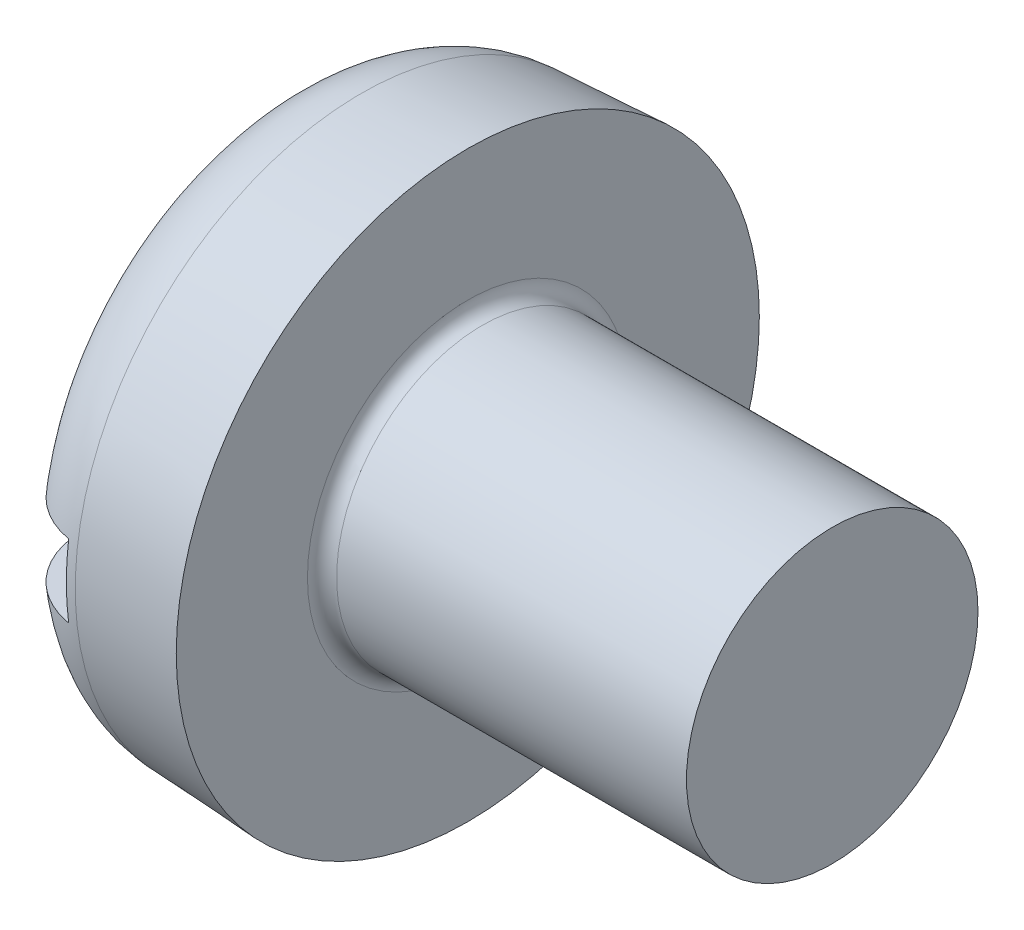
ISO-10303-21;
HEADER;
FILE_DESCRIPTION(('STEP AP214'),'2;1');
FILE_NAME('part.step','',(''),(''),'','','');
FILE_SCHEMA(('AUTOMOTIVE_DESIGN { 1 0 10303 214 1 1 1 1 }'));
ENDSEC;
DATA;
#1=APPLICATION_CONTEXT('core data for automotive mechanical design processes');
#2=APPLICATION_PROTOCOL_DEFINITION('international standard','automotive_design',2000,#1);
#3=PRODUCT_CONTEXT('',#1,'mechanical');
#4=PRODUCT('Part','Part','',(#3));
#5=PRODUCT_RELATED_PRODUCT_CATEGORY('part','',(#4));
#6=PRODUCT_DEFINITION_FORMATION('','',#4);
#7=PRODUCT_DEFINITION_CONTEXT('part definition',#1,'design');
#8=PRODUCT_DEFINITION('design','',#6,#7);
#9=PRODUCT_DEFINITION_SHAPE('','',#8);
#10=(LENGTH_UNIT() NAMED_UNIT(*) SI_UNIT(.MILLI.,.METRE.));
#11=(NAMED_UNIT(*) PLANE_ANGLE_UNIT() SI_UNIT($,.RADIAN.));
#12=(NAMED_UNIT(*) SI_UNIT($,.STERADIAN.) SOLID_ANGLE_UNIT());
#13=UNCERTAINTY_MEASURE_WITH_UNIT(LENGTH_MEASURE(1.E-05),#10,'distance_accuracy_value','');
#14=(GEOMETRIC_REPRESENTATION_CONTEXT(3) GLOBAL_UNCERTAINTY_ASSIGNED_CONTEXT((#13)) GLOBAL_UNIT_ASSIGNED_CONTEXT((#10,
#11,#12)) REPRESENTATION_CONTEXT('',''));
#15=CARTESIAN_POINT('',(0.,0.,0.));
#16=DIRECTION('',(0.,0.,1.));
#17=DIRECTION('',(1.,0.,0.));
#18=AXIS2_PLACEMENT_3D('',#15,#16,#17);
#19=CARTESIAN_POINT('',(0.,0.,0.));
#20=DIRECTION('',(1.,0.,0.));
#21=DIRECTION('',(0.,0.,-1.));
#22=AXIS2_PLACEMENT_3D('',#19,#20,#21);
#23=PLANE('',#22);
#24=CARTESIAN_POINT('',(0.,0.,0.));
#25=DIRECTION('',(1.,0.,0.));
#26=DIRECTION('',(0.,0.,-1.));
#27=AXIS2_PLACEMENT_3D('',#24,#25,#26);
#28=CIRCLE('',#27,1.36249114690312);
#29=CARTESIAN_POINT('',(0.,0.25,1.33935884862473));
#30=VERTEX_POINT('',#29);
#31=CARTESIAN_POINT('',(0.,0.25,-1.33935884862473));
#32=VERTEX_POINT('',#31);
#33=EDGE_CURVE('E104',#30,#32,#28,.F.);
#34=ORIENTED_EDGE('',*,*,#33,.T.);
#35=DIRECTION('',(0.,0.,1.));
#36=VECTOR('',#35,1.);
#37=CARTESIAN_POINT('',(0.,0.25,-2.));
#38=LINE('',#37,#36);
#39=EDGE_CURVE('E96',#32,#30,#38,.T.);
#40=ORIENTED_EDGE('',*,*,#39,.T.);
#41=EDGE_LOOP('',(#34,#40));
#42=FACE_BOUND('',#41,.T.);
#43=ADVANCED_FACE('F43',(#42),#23,.F.);
#44=CARTESIAN_POINT('',(1.3,0.,0.));
#45=DIRECTION('',(1.,0.,0.));
#46=DIRECTION('',(0.,0.,-1.));
#47=AXIS2_PLACEMENT_3D('',#44,#45,#46);
#48=PLANE('',#47);
#49=CARTESIAN_POINT('',(1.3,0.,0.));
#50=DIRECTION('',(1.,0.,0.));
#51=DIRECTION('',(0.,0.,-1.));
#52=AXIS2_PLACEMENT_3D('',#49,#50,#51);
#53=CIRCLE('',#52,1.1);
#54=CARTESIAN_POINT('',(1.3,0.,-1.1));
#55=VERTEX_POINT('',#54);
#56=EDGE_CURVE('E11',#55,#55,#53,.F.);
#57=ORIENTED_EDGE('',*,*,#56,.T.);
#58=EDGE_LOOP('',(#57));
#59=FACE_BOUND('',#58,.T.);
#60=CARTESIAN_POINT('',(1.3,0.,0.));
#61=DIRECTION('',(1.,0.,0.));
#62=DIRECTION('',(0.,0.,-1.));
#63=AXIS2_PLACEMENT_3D('',#60,#61,#62);
#64=CIRCLE('',#63,2.);
#65=CARTESIAN_POINT('',(1.3,0.,-2.));
#66=VERTEX_POINT('',#65);
#67=EDGE_CURVE('E178',#66,#66,#64,.T.);
#68=ORIENTED_EDGE('',*,*,#67,.T.);
#69=EDGE_LOOP('',(#68));
#70=FACE_BOUND('',#69,.T.);
#71=ADVANCED_FACE('F155',(#59,#70),#48,.T.);
#72=CARTESIAN_POINT('',(1.3,0.,0.));
#73=DIRECTION('',(1.,0.,0.));
#74=DIRECTION('',(0.,0.,-1.));
#75=AXIS2_PLACEMENT_3D('',#72,#73,#74);
#76=CONICAL_SURFACE('',#75,2.,0.05235987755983);
#77=CARTESIAN_POINT('',(0.568598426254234,0.,0.));
#78=DIRECTION('',(1.,0.,0.));
#79=DIRECTION('',(0.,0.,-1.));
#80=AXIS2_PLACEMENT_3D('',#77,#78,#79);
#81=CIRCLE('',#80,1.96166886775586);
#82=CARTESIAN_POINT('',(0.568598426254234,0.,-1.96166886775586));
#83=VERTEX_POINT('',#82);
#84=EDGE_CURVE('E108',#83,#83,#81,.T.);
#85=ORIENTED_EDGE('',*,*,#84,.T.);
#86=EDGE_LOOP('',(#85));
#87=FACE_BOUND('',#86,.T.);
#88=ORIENTED_EDGE('',*,*,#67,.F.);
#89=EDGE_LOOP('',(#88));
#90=FACE_BOUND('',#89,.T.);
#91=ADVANCED_FACE('F157',(#87,#90),#76,.T.);
#92=CARTESIAN_POINT('',(0.,-0.25,-1.33935884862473));
#93=VERTEX_POINT('',#92);
#94=CARTESIAN_POINT('',(0.,-0.25,1.33935884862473));
#95=VERTEX_POINT('',#94);
#96=EDGE_CURVE('E97',#93,#95,#28,.F.);
#97=ORIENTED_EDGE('',*,*,#96,.T.);
#98=DIRECTION('',(0.,0.,1.));
#99=VECTOR('',#98,1.);
#100=CARTESIAN_POINT('',(0.,-0.25,-2.));
#101=LINE('',#100,#99);
#102=EDGE_CURVE('E59',#93,#95,#101,.T.);
#103=ORIENTED_EDGE('',*,*,#102,.F.);
#104=EDGE_LOOP('',(#97,#103));
#105=FACE_BOUND('',#104,.T.);
#106=ADVANCED_FACE('F98',(#105),#23,.F.);
#107=CARTESIAN_POINT('',(3.8,0.,0.));
#108=DIRECTION('',(-1.,0.,0.));
#109=DIRECTION('',(0.,0.,1.));
#110=AXIS2_PLACEMENT_3D('',#107,#108,#109);
#111=CYLINDRICAL_SURFACE('',#110,1.);
#112=CARTESIAN_POINT('',(1.4,0.,0.));
#113=DIRECTION('',(1.,0.,0.));
#114=DIRECTION('',(0.,0.,-1.));
#115=AXIS2_PLACEMENT_3D('',#112,#113,#114);
#116=CIRCLE('',#115,1.);
#117=CARTESIAN_POINT('',(1.4,0.,-1.));
#118=VERTEX_POINT('',#117);
#119=EDGE_CURVE('E51',#118,#118,#116,.T.);
#120=ORIENTED_EDGE('',*,*,#119,.T.);
#121=EDGE_LOOP('',(#120));
#122=FACE_BOUND('',#121,.T.);
#123=CARTESIAN_POINT('',(3.8,0.,0.));
#124=DIRECTION('',(1.,0.,0.));
#125=DIRECTION('',(0.,0.,-1.));
#126=AXIS2_PLACEMENT_3D('',#123,#124,#125);
#127=CIRCLE('',#126,1.);
#128=CARTESIAN_POINT('',(3.8,0.,-1.));
#129=VERTEX_POINT('',#128);
#130=EDGE_CURVE('E181',#129,#129,#127,.T.);
#131=ORIENTED_EDGE('',*,*,#130,.F.);
#132=EDGE_LOOP('',(#131));
#133=FACE_BOUND('',#132,.T.);
#134=ADVANCED_FACE('F145',(#122,#133),#111,.T.);
#135=CARTESIAN_POINT('',(3.8,0.,0.));
#136=DIRECTION('',(1.,0.,0.));
#137=DIRECTION('',(0.,0.,-1.));
#138=AXIS2_PLACEMENT_3D('',#135,#136,#137);
#139=PLANE('',#138);
#140=ORIENTED_EDGE('',*,*,#130,.T.);
#141=EDGE_LOOP('',(#140));
#142=FACE_BOUND('',#141,.T.);
#143=ADVANCED_FACE('F166',(#142),#139,.T.);
#144=CARTESIAN_POINT('',(0.6,0.,0.));
#145=DIRECTION('',(1.,0.,0.));
#146=DIRECTION('',(0.,0.,-1.));
#147=AXIS2_PLACEMENT_3D('',#144,#145,#146);
#148=TOROIDAL_SURFACE('',#147,1.36249114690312,0.6);
#149=CARTESIAN_POINT('',(0.274857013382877,0.25,-1.849938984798));
#150=CARTESIAN_POINT('',(0.302936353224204,0.25,-1.86820702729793));
#151=CARTESIAN_POINT('',(0.332572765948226,0.25,-1.88412501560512));
#152=CARTESIAN_POINT('',(0.394120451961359,0.25,-1.91077520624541));
#153=CARTESIAN_POINT('',(0.426034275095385,0.25,-1.92150148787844));
#154=CARTESIAN_POINT('',(0.49120380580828,0.25,-1.93743324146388));
#155=CARTESIAN_POINT('',(0.524459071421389,0.25,-1.94264051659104));
#156=CARTESIAN_POINT('',(0.59136310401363,0.25,-1.94738383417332));
#157=CARTESIAN_POINT('',(0.625011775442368,0.25,-1.94692122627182));
#158=CARTESIAN_POINT('',(0.691689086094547,0.25,-1.94034863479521));
#159=CARTESIAN_POINT('',(0.724718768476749,0.25,-1.93424922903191));
#160=CARTESIAN_POINT('',(0.789287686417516,0.25,-1.91659655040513));
#161=CARTESIAN_POINT('',(0.820826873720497,0.25,-1.90504310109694));
#162=CARTESIAN_POINT('',(0.88155458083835,0.25,-1.87680629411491));
#163=CARTESIAN_POINT('',(0.910740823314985,0.25,-1.86011804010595));
#164=CARTESIAN_POINT('',(0.965914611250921,0.25,-1.82210085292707));
#165=CARTESIAN_POINT('',(0.991902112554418,0.25,-1.80077185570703));
#166=CARTESIAN_POINT('',(1.04008275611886,0.25,-1.75397339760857));
#167=CARTESIAN_POINT('',(1.0622567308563,0.25,-1.72848420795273));
#168=CARTESIAN_POINT('',(1.10205491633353,0.25,-1.67417327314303));
#169=CARTESIAN_POINT('',(1.11967897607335,0.25,-1.6453514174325));
#170=CARTESIAN_POINT('',(1.15005364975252,0.25,-1.58492097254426));
#171=CARTESIAN_POINT('',(1.16275913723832,0.25,-1.55328970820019));
#172=CARTESIAN_POINT('',(1.18275419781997,0.25,-1.48836055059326));
#173=CARTESIAN_POINT('',(1.19004345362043,0.25,-1.45506255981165));
#174=CARTESIAN_POINT('',(1.19910602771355,0.25,-1.38728543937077));
#175=CARTESIAN_POINT('',(1.20080664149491,0.25,-1.35279659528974));
#176=CARTESIAN_POINT('',(1.19848636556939,0.25,-1.28401260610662));
#177=CARTESIAN_POINT('',(1.19446500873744,0.25,-1.24971747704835));
#178=CARTESIAN_POINT('',(1.18074505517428,0.25,-1.18173220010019));
#179=CARTESIAN_POINT('',(1.17096001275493,0.25,-1.14805949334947));
#180=CARTESIAN_POINT('',(1.14594404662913,0.25,-1.08280004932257));
#181=CARTESIAN_POINT('',(1.1307125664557,0.25,-1.05121352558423));
#182=CARTESIAN_POINT('',(1.09501500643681,0.25,-0.990638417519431));
#183=CARTESIAN_POINT('',(1.07448864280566,0.25,-0.961685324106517));
#184=CARTESIAN_POINT('',(1.0288425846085,0.25,-0.907651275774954));
#185=CARTESIAN_POINT('',(1.00372253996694,0.25,-0.882570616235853));
#186=CARTESIAN_POINT('',(0.949701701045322,0.25,-0.837204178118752));
#187=CARTESIAN_POINT('',(0.92082244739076,0.25,-0.816892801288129));
#188=CARTESIAN_POINT('',(0.859958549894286,0.25,-0.781624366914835));
#189=CARTESIAN_POINT('',(0.827974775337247,0.25,-0.766665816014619));
#190=CARTESIAN_POINT('',(0.763077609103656,0.25,-0.743184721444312));
#191=CARTESIAN_POINT('',(0.730244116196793,0.25,-0.734441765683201));
#192=CARTESIAN_POINT('',(0.663551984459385,0.25,-0.722905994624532));
#193=CARTESIAN_POINT('',(0.629693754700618,0.25,-0.72011083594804));
#194=CARTESIAN_POINT('',(0.563641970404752,0.25,-0.720591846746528));
#195=CARTESIAN_POINT('',(0.531445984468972,0.25,-0.723585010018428));
#196=CARTESIAN_POINT('',(0.468019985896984,0.25,-0.734949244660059));
#197=CARTESIAN_POINT('',(0.436790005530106,0.25,-0.743320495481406));
#198=CARTESIAN_POINT('',(0.376193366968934,0.25,-0.765073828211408));
#199=CARTESIAN_POINT('',(0.34682374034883,0.25,-0.778447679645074));
#200=CARTESIAN_POINT('',(0.290607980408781,0.25,-0.809726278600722));
#201=CARTESIAN_POINT('',(0.26376234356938,0.25,-0.827631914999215));
#202=CARTESIAN_POINT('',(0.212060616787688,0.25,-0.868327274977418));
#203=CARTESIAN_POINT('',(0.187349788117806,0.25,-0.891301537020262));
#204=CARTESIAN_POINT('',(0.141945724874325,0.25,-0.940926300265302));
#205=CARTESIAN_POINT('',(0.121253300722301,0.25,-0.967577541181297));
#206=CARTESIAN_POINT('',(0.0836353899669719,0.25,-1.02499135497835));
#207=CARTESIAN_POINT('',(0.0668976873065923,0.25,-1.05587718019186));
#208=CARTESIAN_POINT('',(0.0387781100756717,0.25,-1.11999926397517));
#209=CARTESIAN_POINT('',(0.0273966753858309,0.25,-1.15323571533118));
#210=CARTESIAN_POINT('',(0.0102356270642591,0.25,-1.22151679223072));
#211=CARTESIAN_POINT('',(0.00451889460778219,0.25,-1.25657726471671));
#212=CARTESIAN_POINT('',(-0.000885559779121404,0.25,-1.32715990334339));
#213=CARTESIAN_POINT('',(-0.000573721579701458,0.25,-1.36268203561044));
#214=CARTESIAN_POINT('',(0.00608419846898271,0.25,-1.43280639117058));
#215=CARTESIAN_POINT('',(0.0123711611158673,0.25,-1.46741421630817));
#216=CARTESIAN_POINT('',(0.030761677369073,0.25,-1.53505954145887));
#217=CARTESIAN_POINT('',(0.0428662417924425,0.25,-1.56809676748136));
#218=CARTESIAN_POINT('',(0.07234801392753,0.25,-1.63111850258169));
#219=CARTESIAN_POINT('',(0.0896431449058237,0.25,-1.66114146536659));
#220=CARTESIAN_POINT('',(0.129084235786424,0.25,-1.71777423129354));
#221=CARTESIAN_POINT('',(0.151223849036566,0.25,-1.74438842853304));
#222=CARTESIAN_POINT('',(0.190518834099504,0.25,-1.78413013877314));
#223=CARTESIAN_POINT('',(0.206389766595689,0.25,-1.79855000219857));
#224=CARTESIAN_POINT('',(0.239580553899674,0.25,-1.82561325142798));
#225=CARTESIAN_POINT('',(0.256900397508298,0.25,-1.83825665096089));
#226=CARTESIAN_POINT('',(0.274857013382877,0.25,-1.849938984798));
#227=B_SPLINE_CURVE_WITH_KNOTS('',3,(#149,#150,#151,#152,#153,#154,#155,#156,#157,#158,#159,
#160,#161,#162,#163,#164,#165,#166,#167,#168,#169,#170,#171,#172,#173,#174,#175,#176,#177,#178,
#179,#180,#181,#182,#183,#184,#185,#186,#187,#188,#189,#190,#191,#192,#193,#194,#195,#196,#197,
#198,#199,#200,#201,#202,#203,#204,#205,#206,#207,#208,#209,#210,#211,#212,#213,#214,#215,#216,
#217,#218,#219,#220,#221,#222,#223,#224,#225,#226),.UNSPECIFIED.,.T.,.F.,(4,2,2,2,2,2,2,2,2,2,2,
2,2,2,2,2,2,2,2,2,2,2,2,2,2,2,2,2,2,2,2,2,2,2,2,2,2,2,4),(0.,0.100418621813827,
0.200951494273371,0.301451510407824,0.401927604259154,0.502215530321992,0.602506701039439,
0.702893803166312,0.80328229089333,0.904161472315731,1.00504400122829,1.10683132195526,
1.20862460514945,1.31173701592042,1.41485784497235,1.51956617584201,1.62428520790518,
1.73025359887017,1.83623006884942,1.94162401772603,2.0469885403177,2.14839996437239,
2.24977142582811,2.34631159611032,2.44285498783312,2.53924023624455,2.63564440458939,
2.73641666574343,2.83720922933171,2.94210761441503,3.04701461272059,3.15307350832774,
3.25912466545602,3.36413733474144,3.46916825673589,3.57261880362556,3.67593462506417,
3.74015239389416,3.80436966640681),.UNSPECIFIED.);
#228=CARTESIAN_POINT('',(0.5,0.25,-1.93804112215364));
#229=VERTEX_POINT('',#228);
#230=EDGE_CURVE('E132',#32,#229,#227,.T.);
#231=ORIENTED_EDGE('',*,*,#230,.F.);
#232=ORIENTED_EDGE('',*,*,#33,.F.);
#233=CARTESIAN_POINT('',(0.263812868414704,0.25,0.828630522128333));
#234=CARTESIAN_POINT('',(0.29069689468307,0.25,0.809635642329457));
#235=CARTESIAN_POINT('',(0.319137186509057,0.25,0.792812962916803));
#236=CARTESIAN_POINT('',(0.378430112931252,0.25,0.764099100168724));
#237=CARTESIAN_POINT('',(0.409284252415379,0.25,0.752211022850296));
#238=CARTESIAN_POINT('',(0.472622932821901,0.25,0.733837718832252));
#239=CARTESIAN_POINT('',(0.505109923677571,0.25,0.727360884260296));
#240=CARTESIAN_POINT('',(0.570707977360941,0.25,0.720141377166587));
#241=CARTESIAN_POINT('',(0.603818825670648,0.25,0.719396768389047));
#242=CARTESIAN_POINT('',(0.668731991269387,0.25,0.723610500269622));
#243=CARTESIAN_POINT('',(0.700544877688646,0.25,0.72840860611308));
#244=CARTESIAN_POINT('',(0.762926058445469,0.25,0.743234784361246));
#245=CARTESIAN_POINT('',(0.793494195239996,0.25,0.753263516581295));
#246=CARTESIAN_POINT('',(0.852845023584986,0.25,0.778263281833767));
#247=CARTESIAN_POINT('',(0.881609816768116,0.25,0.793276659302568));
#248=CARTESIAN_POINT('',(0.936370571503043,0.25,0.827703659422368));
#249=CARTESIAN_POINT('',(0.962365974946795,0.25,0.847118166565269));
#250=CARTESIAN_POINT('',(1.01217101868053,0.25,0.890802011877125));
#251=CARTESIAN_POINT('',(1.0358152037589,0.25,0.915260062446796));
#252=CARTESIAN_POINT('',(1.07884068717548,0.25,0.96767606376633));
#253=CARTESIAN_POINT('',(1.09822119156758,0.25,0.995634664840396));
#254=CARTESIAN_POINT('',(1.13285489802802,0.25,1.0553731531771));
#255=CARTESIAN_POINT('',(1.14793269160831,0.25,1.08725492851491));
#256=CARTESIAN_POINT('',(1.17256277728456,0.25,1.15308743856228));
#257=CARTESIAN_POINT('',(1.18211474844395,0.25,1.18703829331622));
#258=CARTESIAN_POINT('',(1.19543713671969,0.25,1.25628591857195));
#259=CARTESIAN_POINT('',(1.19916998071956,0.25,1.29158994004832));
#260=CARTESIAN_POINT('',(1.20058228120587,0.25,1.3623201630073));
#261=CARTESIAN_POINT('',(1.19826201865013,0.25,1.39774635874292));
#262=CARTESIAN_POINT('',(1.18764933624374,0.25,1.46727585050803));
#263=CARTESIAN_POINT('',(1.17942605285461,0.25,1.50138968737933));
#264=CARTESIAN_POINT('',(1.15727777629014,0.25,1.56771423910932));
#265=CARTESIAN_POINT('',(1.14335324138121,0.25,1.59992510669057));
#266=CARTESIAN_POINT('',(1.11043434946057,0.25,1.66099593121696));
#267=CARTESIAN_POINT('',(1.09152222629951,0.25,1.68990021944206));
#268=CARTESIAN_POINT('',(1.04905354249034,0.25,1.74406804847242));
#269=CARTESIAN_POINT('',(1.02549732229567,0.25,1.76933185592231));
#270=CARTESIAN_POINT('',(0.974745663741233,0.25,1.81515586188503));
#271=CARTESIAN_POINT('',(0.947601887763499,0.25,1.83577329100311));
#272=CARTESIAN_POINT('',(0.890212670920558,0.25,1.87210973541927));
#273=CARTESIAN_POINT('',(0.859967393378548,0.25,1.88782900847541));
#274=CARTESIAN_POINT('',(0.79752605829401,0.25,1.9137825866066));
#275=CARTESIAN_POINT('',(0.765349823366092,0.25,1.92406459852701));
#276=CARTESIAN_POINT('',(0.699723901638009,0.25,1.93905196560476));
#277=CARTESIAN_POINT('',(0.666274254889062,0.25,1.94375749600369));
#278=CARTESIAN_POINT('',(0.599220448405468,0.25,1.94744392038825));
#279=CARTESIAN_POINT('',(0.565617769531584,0.25,1.94645180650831));
#280=CARTESIAN_POINT('',(0.499057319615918,0.25,1.93883518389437));
#281=CARTESIAN_POINT('',(0.466099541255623,0.25,1.93221073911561));
#282=CARTESIAN_POINT('',(0.401789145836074,0.25,1.91353136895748));
#283=CARTESIAN_POINT('',(0.370435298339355,0.25,1.90148067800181));
#284=CARTESIAN_POINT('',(0.310187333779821,0.25,1.8723020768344));
#285=CARTESIAN_POINT('',(0.281293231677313,0.25,1.8551741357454));
#286=CARTESIAN_POINT('',(0.226684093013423,0.25,1.81627753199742));
#287=CARTESIAN_POINT('',(0.200979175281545,0.25,1.79449466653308));
#288=CARTESIAN_POINT('',(0.153560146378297,0.25,1.74695000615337));
#289=CARTESIAN_POINT('',(0.131846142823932,0.25,1.72118810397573));
#290=CARTESIAN_POINT('',(0.0928534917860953,0.25,1.66622636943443));
#291=CARTESIAN_POINT('',(0.0756074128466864,0.25,1.63700343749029));
#292=CARTESIAN_POINT('',(0.0462048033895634,0.25,1.57610160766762));
#293=CARTESIAN_POINT('',(0.0340485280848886,0.25,1.54442258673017));
#294=CARTESIAN_POINT('',(0.0150174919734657,0.25,1.47913025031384));
#295=CARTESIAN_POINT('',(0.00820357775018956,0.25,1.44549920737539));
#296=CARTESIAN_POINT('',(0.000231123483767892,0.25,1.37757567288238));
#297=CARTESIAN_POINT('',(-0.000927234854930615,0.25,1.34328316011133));
#298=CARTESIAN_POINT('',(0.00242309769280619,0.25,1.27447559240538));
#299=CARTESIAN_POINT('',(0.00701461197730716,0.25,1.23996457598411));
#300=CARTESIAN_POINT('',(0.0218410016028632,0.25,1.17216760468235));
#301=CARTESIAN_POINT('',(0.0320777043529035,0.25,1.13888205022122));
#302=CARTESIAN_POINT('',(0.058082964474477,0.25,1.07396328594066));
#303=CARTESIAN_POINT('',(0.0739328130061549,0.25,1.0423626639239));
#304=CARTESIAN_POINT('',(0.110678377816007,0.25,0.982274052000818));
#305=CARTESIAN_POINT('',(0.131569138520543,0.25,0.953783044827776));
#306=CARTESIAN_POINT('',(0.170842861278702,0.25,0.908735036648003));
#307=CARTESIAN_POINT('',(0.188083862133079,0.25,0.891169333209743));
#308=CARTESIAN_POINT('',(0.224531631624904,0.25,0.858208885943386));
#309=CARTESIAN_POINT('',(0.243738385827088,0.25,0.842814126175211));
#310=CARTESIAN_POINT('',(0.263812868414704,0.25,0.828630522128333));
#311=B_SPLINE_CURVE_WITH_KNOTS('',3,(#233,#234,#235,#236,#237,#238,#239,#240,#241,#242,#243,
#244,#245,#246,#247,#248,#249,#250,#251,#252,#253,#254,#255,#256,#257,#258,#259,#260,#261,#262,
#263,#264,#265,#266,#267,#268,#269,#270,#271,#272,#273,#274,#275,#276,#277,#278,#279,#280,#281,
#282,#283,#284,#285,#286,#287,#288,#289,#290,#291,#292,#293,#294,#295,#296,#297,#298,#299,#300,
#301,#302,#303,#304,#305,#306,#307,#308,#309,#310),.UNSPECIFIED.,.T.,.F.,(4,2,2,2,2,2,2,2,2,2,2,
2,2,2,2,2,2,2,2,2,2,2,2,2,2,2,2,2,2,2,2,2,2,2,2,2,2,2,4),(0.,0.0986685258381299,
0.197399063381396,0.29628243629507,0.39513240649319,0.491194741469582,0.58726919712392,
0.684181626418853,0.781113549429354,0.882711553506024,0.984328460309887,1.08963497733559,
1.19494760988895,1.30093745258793,1.40692237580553,1.51168583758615,1.61644088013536,
1.71956638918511,1.82268434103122,1.92445275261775,2.02621580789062,2.12707051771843,
2.22792205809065,2.32829621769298,2.42866923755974,2.52896406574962,2.62925950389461,
2.7298654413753,2.83047409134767,2.93179670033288,3.03312438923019,3.13559002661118,
3.23805895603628,3.34202101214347,3.44601674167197,3.55158468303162,3.65704926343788,
3.73072625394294,3.80440270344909),.UNSPECIFIED.);
#312=CARTESIAN_POINT('',(0.5,0.25,1.93804112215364));
#313=VERTEX_POINT('',#312);
#314=EDGE_CURVE('E95',#313,#30,#311,.T.);
#315=ORIENTED_EDGE('',*,*,#314,.F.);
#316=CARTESIAN_POINT('',(0.5,0.,0.));
#317=DIRECTION('',(1.,0.,0.));
#318=DIRECTION('',(0.,1.,0.));
#319=AXIS2_PLACEMENT_3D('',#316,#317,#318);
#320=CIRCLE('',#319,1.95409912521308);
#321=CARTESIAN_POINT('',(0.5,-0.25,1.93804112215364));
#322=VERTEX_POINT('',#321);
#323=EDGE_CURVE('E68',#322,#313,#320,.F.);
#324=ORIENTED_EDGE('',*,*,#323,.F.);
#325=CARTESIAN_POINT('',(0.263812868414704,-0.25,0.828630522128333));
#326=CARTESIAN_POINT('',(0.235224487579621,-0.25,0.848832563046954));
#327=CARTESIAN_POINT('',(0.208355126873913,-0.25,0.871521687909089));
#328=CARTESIAN_POINT('',(0.158788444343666,-0.25,0.921121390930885));
#329=CARTESIAN_POINT('',(0.136098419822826,-0.25,0.948039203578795));
#330=CARTESIAN_POINT('',(0.0955453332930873,-0.25,1.00524201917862));
#331=CARTESIAN_POINT('',(0.0776758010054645,-0.25,1.03552243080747));
#332=CARTESIAN_POINT('',(0.0472181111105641,-0.25,1.09861633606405));
#333=CARTESIAN_POINT('',(0.0346279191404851,-0.25,1.13142884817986));
#334=CARTESIAN_POINT('',(0.01498078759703,-0.25,1.19905246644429));
#335=CARTESIAN_POINT('',(0.00798404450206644,-0.25,1.23388109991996));
#336=CARTESIAN_POINT('',(-1.14958607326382E-05,-0.25,1.30422444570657));
#337=CARTESIAN_POINT('',(-0.00100998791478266,-0.25,1.33973919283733));
#338=CARTESIAN_POINT('',(0.00305166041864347,-0.25,1.41012688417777));
#339=CARTESIAN_POINT('',(0.00806167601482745,-0.25,1.44500270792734));
#340=CARTESIAN_POINT('',(0.0239595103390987,-0.25,1.51338868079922));
#341=CARTESIAN_POINT('',(0.0348468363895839,-0.25,1.54689894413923));
#342=CARTESIAN_POINT('',(0.0620088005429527,-0.25,1.61105155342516));
#343=CARTESIAN_POINT('',(0.0781979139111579,-0.25,1.64173011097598));
#344=CARTESIAN_POINT('',(0.115567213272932,-0.25,1.69988038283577));
#345=CARTESIAN_POINT('',(0.136747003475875,-0.25,1.7273523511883));
#346=CARTESIAN_POINT('',(0.183170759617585,-0.25,1.77790333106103));
#347=CARTESIAN_POINT('',(0.20835339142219,-0.25,1.80103868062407));
#348=CARTESIAN_POINT('',(0.262279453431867,-0.25,1.84270088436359));
#349=CARTESIAN_POINT('',(0.291022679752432,-0.25,1.86122800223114));
#350=CARTESIAN_POINT('',(0.350938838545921,-0.25,1.89295713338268));
#351=CARTESIAN_POINT('',(0.382084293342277,-0.25,1.90621104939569));
#352=CARTESIAN_POINT('',(0.446166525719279,-0.25,1.92726691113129));
#353=CARTESIAN_POINT('',(0.479103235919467,-0.25,1.93506906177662));
#354=CARTESIAN_POINT('',(0.545625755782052,-0.25,1.94496067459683));
#355=CARTESIAN_POINT('',(0.579206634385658,-0.25,1.94708332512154));
#356=CARTESIAN_POINT('',(0.646246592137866,-0.25,1.94564923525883));
#357=CARTESIAN_POINT('',(0.679705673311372,-0.25,1.94209258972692));
#358=CARTESIAN_POINT('',(0.745488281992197,-0.25,1.92941655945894));
#359=CARTESIAN_POINT('',(0.777813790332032,-0.25,1.92030744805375));
#360=CARTESIAN_POINT('',(0.840481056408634,-0.25,1.89680209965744));
#361=CARTESIAN_POINT('',(0.870822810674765,-0.25,1.88240585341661));
#362=CARTESIAN_POINT('',(0.928731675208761,-0.25,1.84871105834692));
#363=CARTESIAN_POINT('',(0.956293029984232,-0.249999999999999,1.82940262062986));
#364=CARTESIAN_POINT('',(1.00780674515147,-0.249999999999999,1.78645801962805));
#365=CARTESIAN_POINT('',(1.03175903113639,-0.249999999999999,1.7628217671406));
#366=CARTESIAN_POINT('',(1.07553458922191,-0.249999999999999,1.71174700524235));
#367=CARTESIAN_POINT('',(1.09533229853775,-0.249999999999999,1.68428659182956));
#368=CARTESIAN_POINT('',(1.13008922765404,-0.249999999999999,1.62645897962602));
#369=CARTESIAN_POINT('',(1.14504825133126,-0.249999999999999,1.59609166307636));
#370=CARTESIAN_POINT('',(1.16987221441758,-0.249999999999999,1.53298784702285));
#371=CARTESIAN_POINT('',(1.17968419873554,-0.249999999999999,1.50023052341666));
#372=CARTESIAN_POINT('',(1.19375141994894,-0.249999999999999,1.43354483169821));
#373=CARTESIAN_POINT('',(1.19800629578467,-0.249999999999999,1.39961638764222));
#374=CARTESIAN_POINT('',(1.20090606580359,-0.249999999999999,1.33104884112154));
#375=CARTESIAN_POINT('',(1.1994722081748,-0.249999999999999,1.29640641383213));
#376=CARTESIAN_POINT('',(1.19090077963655,-0.249999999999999,1.22783492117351));
#377=CARTESIAN_POINT('',(1.18376271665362,-0.249999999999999,1.19390591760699));
#378=CARTESIAN_POINT('',(1.1638600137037,-0.249999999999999,1.12717293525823));
#379=CARTESIAN_POINT('',(1.15101086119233,-0.249999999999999,1.09439415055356));
#380=CARTESIAN_POINT('',(1.12004164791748,-0.249999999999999,1.03142582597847));
#381=CARTESIAN_POINT('',(1.1019210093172,-0.249999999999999,1.00123657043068));
#382=CARTESIAN_POINT('',(1.06071562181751,-0.249999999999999,0.944044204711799));
#383=CARTESIAN_POINT('',(1.03758799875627,-0.249999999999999,0.917071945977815));
#384=CARTESIAN_POINT('',(0.987077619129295,-0.249999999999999,0.867449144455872));
#385=CARTESIAN_POINT('',(0.959694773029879,-0.25,0.844798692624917));
#386=CARTESIAN_POINT('',(0.901798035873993,-0.25,0.804862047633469));
#387=CARTESIAN_POINT('',(0.87133108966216,-0.25,0.787507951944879));
#388=CARTESIAN_POINT('',(0.807818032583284,-0.25,0.758439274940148));
#389=CARTESIAN_POINT('',(0.774773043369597,-0.25,0.746722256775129));
#390=CARTESIAN_POINT('',(0.70863254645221,-0.25,0.729846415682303));
#391=CARTESIAN_POINT('',(0.675606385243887,-0.25,0.724415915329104));
#392=CARTESIAN_POINT('',(0.609107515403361,-0.25,0.719437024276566));
#393=CARTESIAN_POINT('',(0.575634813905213,-0.25,0.719888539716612));
#394=CARTESIAN_POINT('',(0.510611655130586,-0.25,0.726513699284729));
#395=CARTESIAN_POINT('',(0.479037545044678,-0.25,0.732460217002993));
#396=CARTESIAN_POINT('',(0.417338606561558,-0.25,0.74949345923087));
#397=CARTESIAN_POINT('',(0.387212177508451,-0.25,0.760574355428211));
#398=CARTESIAN_POINT('',(0.341675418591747,-0.25,0.781643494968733));
#399=CARTESIAN_POINT('',(0.325512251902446,-0.25,0.790049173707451));
#400=CARTESIAN_POINT('',(0.29401537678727,-0.25,0.808289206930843));
#401=CARTESIAN_POINT('',(0.278681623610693,-0.25,0.818123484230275));
#402=CARTESIAN_POINT('',(0.263812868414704,-0.25,0.828630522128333));
#403=B_SPLINE_CURVE_WITH_KNOTS('',3,(#325,#326,#327,#328,#329,#330,#331,#332,#333,#334,#335,
#336,#337,#338,#339,#340,#341,#342,#343,#344,#345,#346,#347,#348,#349,#350,#351,#352,#353,#354,
#355,#356,#357,#358,#359,#360,#361,#362,#363,#364,#365,#366,#367,#368,#369,#370,#371,#372,#373,
#374,#375,#376,#377,#378,#379,#380,#381,#382,#383,#384,#385,#386,#387,#388,#389,#390,#391,#392,
#393,#394,#395,#396,#397,#398,#399,#400,#401,#402),.UNSPECIFIED.,.T.,.F.,(4,2,2,2,2,2,2,2,2,2,2,
2,2,2,2,2,2,2,2,2,2,2,2,2,2,2,2,2,2,2,2,2,2,2,2,2,2,2,4),(0.,0.104949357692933,
0.210080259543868,0.315069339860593,0.420017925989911,0.526081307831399,0.632150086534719,
0.737340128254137,0.842521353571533,0.946083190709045,1.04963681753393,1.15173437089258,
1.25382608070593,1.35488647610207,1.45594307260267,1.55640783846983,1.6568709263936,
1.75714869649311,1.85742664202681,1.95790808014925,2.05839158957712,2.1594763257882,
2.26056515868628,2.36267459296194,2.46479066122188,2.56832526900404,2.67186880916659,
2.77699842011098,2.88213955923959,2.98821937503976,3.09430142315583,3.19895999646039,
3.3035732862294,3.40347354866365,3.50337221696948,3.5993179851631,3.6951551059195,
3.74974198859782,3.80432592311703),.UNSPECIFIED.);
#404=EDGE_CURVE('E101',#95,#322,#403,.T.);
#405=ORIENTED_EDGE('',*,*,#404,.F.);
#406=ORIENTED_EDGE('',*,*,#96,.F.);
#407=CARTESIAN_POINT('',(0.274857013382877,-0.25,-1.849938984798));
#408=CARTESIAN_POINT('',(0.246486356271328,-0.25,-1.83147774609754));
#409=CARTESIAN_POINT('',(0.219663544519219,-0.25,-1.81058961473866));
#410=CARTESIAN_POINT('',(0.169895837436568,-0.25,-1.76457655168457));
#411=CARTESIAN_POINT('',(0.146956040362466,-0.25,-1.73944613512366));
#412=CARTESIAN_POINT('',(0.10563152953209,-0.25,-1.6857186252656));
#413=CARTESIAN_POINT('',(0.087242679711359,-0.25,-1.65712471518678));
#414=CARTESIAN_POINT('',(0.0554888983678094,-0.25,-1.5972842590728));
#415=CARTESIAN_POINT('',(0.0421227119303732,-0.25,-1.56603837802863));
#416=CARTESIAN_POINT('',(0.0206538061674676,-0.25,-1.50150598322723));
#417=CARTESIAN_POINT('',(0.0125948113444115,-0.25,-1.46820493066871));
#418=CARTESIAN_POINT('',(0.00209594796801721,-0.25,-1.40072817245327));
#419=CARTESIAN_POINT('',(-0.000343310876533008,-0.25,-1.36655237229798));
#420=CARTESIAN_POINT('',(0.00042659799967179,-0.25,-1.2977735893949));
#421=CARTESIAN_POINT('',(0.00371744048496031,-0.25,-1.26317152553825));
#422=CARTESIAN_POINT('',(0.0159720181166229,-0.25,-1.19498712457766));
#423=CARTESIAN_POINT('',(0.024936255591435,-0.25,-1.16140487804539));
#424=CARTESIAN_POINT('',(0.0484391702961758,-0.25,-1.09567996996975));
#425=CARTESIAN_POINT('',(0.0630595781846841,-0.25,-1.06356651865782));
#426=CARTESIAN_POINT('',(0.0974480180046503,-0.25,-1.00222121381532));
#427=CARTESIAN_POINT('',(0.117216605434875,-0.25,-0.972989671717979));
#428=CARTESIAN_POINT('',(0.161518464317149,-0.25,-0.918067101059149));
#429=CARTESIAN_POINT('',(0.186082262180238,-0.25,-0.892400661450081));
#430=CARTESIAN_POINT('',(0.239242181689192,-0.25,-0.845642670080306));
#431=CARTESIAN_POINT('',(0.267838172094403,-0.25,-0.824550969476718));
#432=CARTESIAN_POINT('',(0.327723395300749,-0.25,-0.788039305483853));
#433=CARTESIAN_POINT('',(0.358952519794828,-0.25,-0.772520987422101));
#434=CARTESIAN_POINT('',(0.423661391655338,-0.25,-0.747252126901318));
#435=CARTESIAN_POINT('',(0.457140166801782,-0.25,-0.737499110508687));
#436=CARTESIAN_POINT('',(0.523670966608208,-0.25,-0.724536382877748));
#437=CARTESIAN_POINT('',(0.556666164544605,-0.25,-0.721034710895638));
#438=CARTESIAN_POINT('',(0.622758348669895,-0.25,-0.719836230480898));
#439=CARTESIAN_POINT('',(0.655855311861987,-0.25,-0.722138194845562));
#440=CARTESIAN_POINT('',(0.720052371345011,-0.25,-0.732260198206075));
#441=CARTESIAN_POINT('',(0.751182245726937,-0.25,-0.739893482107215));
#442=CARTESIAN_POINT('',(0.811768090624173,-0.25,-0.760157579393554));
#443=CARTESIAN_POINT('',(0.841223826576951,-0.25,-0.772789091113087));
#444=CARTESIAN_POINT('',(0.898404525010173,-0.25,-0.802945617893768));
#445=CARTESIAN_POINT('',(0.926071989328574,-0.25,-0.820579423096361));
#446=CARTESIAN_POINT('',(0.978239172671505,-0.25,-0.860033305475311));
#447=CARTESIAN_POINT('',(1.00273821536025,-0.249999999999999,-0.8818542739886));
#448=CARTESIAN_POINT('',(1.04912907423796,-0.249999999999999,-0.930234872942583));
#449=CARTESIAN_POINT('',(1.07083266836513,-0.249999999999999,-0.956975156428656));
#450=CARTESIAN_POINT('',(1.10959316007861,-0.249999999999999,-1.01363573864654));
#451=CARTESIAN_POINT('',(1.12664932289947,-0.249999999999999,-1.04355653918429));
#452=CARTESIAN_POINT('',(1.15607819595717,-0.249999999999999,-1.10665807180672));
#453=CARTESIAN_POINT('',(1.16830490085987,-0.249999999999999,-1.13990704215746));
#454=CARTESIAN_POINT('',(1.1870042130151,-0.249999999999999,-1.20798706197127));
#455=CARTESIAN_POINT('',(1.19347668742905,-0.249999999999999,-1.24281814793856));
#456=CARTESIAN_POINT('',(1.2004435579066,-0.249999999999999,-1.31307491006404));
#457=CARTESIAN_POINT('',(1.2009381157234,-0.249999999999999,-1.34850057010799));
#458=CARTESIAN_POINT('',(1.19588624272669,-0.249999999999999,-1.418919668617));
#459=CARTESIAN_POINT('',(1.19034018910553,-0.249999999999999,-1.4539131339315));
#460=CARTESIAN_POINT('',(1.17343956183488,-0.249999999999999,-1.52196071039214));
#461=CARTESIAN_POINT('',(1.16216544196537,-0.249999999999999,-1.55503479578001));
#462=CARTESIAN_POINT('',(1.13413930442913,-0.249999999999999,-1.61877525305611));
#463=CARTESIAN_POINT('',(1.11738772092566,-0.249999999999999,-1.64944181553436));
#464=CARTESIAN_POINT('',(1.07916208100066,-0.249999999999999,-1.70700040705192));
#465=CARTESIAN_POINT('',(1.05776398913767,-0.249999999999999,-1.73394289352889));
#466=CARTESIAN_POINT('',(1.01069799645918,-0.249999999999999,-1.78379750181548));
#467=CARTESIAN_POINT('',(0.98503037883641,-0.25,-1.80670989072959));
#468=CARTESIAN_POINT('',(0.930489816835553,-0.25,-1.84756820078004));
#469=CARTESIAN_POINT('',(0.90165906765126,-0.25,-1.8655704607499));
#470=CARTESIAN_POINT('',(0.841367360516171,-0.25,-1.89643419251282));
#471=CARTESIAN_POINT('',(0.809906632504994,-0.25,-1.90929611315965));
#472=CARTESIAN_POINT('',(0.745515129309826,-0.25,-1.92941695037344));
#473=CARTESIAN_POINT('',(0.712597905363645,-0.25,-1.9367192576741));
#474=CARTESIAN_POINT('',(0.645994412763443,-0.25,-1.9456728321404));
#475=CARTESIAN_POINT('',(0.612307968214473,-0.25,-1.94732279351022));
#476=CARTESIAN_POINT('',(0.54524907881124,-0.25,-1.94492497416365));
#477=CARTESIAN_POINT('',(0.511875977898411,-0.25,-1.94089519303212));
#478=CARTESIAN_POINT('',(0.446310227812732,-0.25,-1.92728944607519));
#479=CARTESIAN_POINT('',(0.414116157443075,-0.25,-1.91772040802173));
#480=CARTESIAN_POINT('',(0.364065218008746,-0.25,-1.89813779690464));
#481=CARTESIAN_POINT('',(0.34554473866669,-0.25,-1.8897758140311));
#482=CARTESIAN_POINT('',(0.309449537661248,-0.25,-1.87121328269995));
#483=CARTESIAN_POINT('',(0.291874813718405,-0.25,-1.8610127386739));
#484=CARTESIAN_POINT('',(0.274857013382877,-0.25,-1.849938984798));
#485=B_SPLINE_CURVE_WITH_KNOTS('',3,(#407,#408,#409,#410,#411,#412,#413,#414,#415,#416,#417,
#418,#419,#420,#421,#422,#423,#424,#425,#426,#427,#428,#429,#430,#431,#432,#433,#434,#435,#436,
#437,#438,#439,#440,#441,#442,#443,#444,#445,#446,#447,#448,#449,#450,#451,#452,#453,#454,#455,
#456,#457,#458,#459,#460,#461,#462,#463,#464,#465,#466,#467,#468,#469,#470,#471,#472,#473,#474,
#475,#476,#477,#478,#479,#480,#481,#482,#483,#484),.UNSPECIFIED.,.T.,.F.,(4,2,2,2,2,2,2,2,2,2,2,
2,2,2,2,2,2,2,2,2,2,2,2,2,2,2,2,2,2,2,2,2,2,2,2,2,2,2,4),(0.,0.101470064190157,
0.203072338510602,0.304581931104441,0.406066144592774,0.508376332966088,0.610697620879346,
0.71448932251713,0.818290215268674,0.923650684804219,1.02902252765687,1.13508843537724,
1.2411508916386,1.34523717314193,1.44927875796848,1.54831979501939,1.6473398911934,
1.74305475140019,1.83878298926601,1.93677796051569,2.03479381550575,2.137644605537,
2.24051164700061,2.34628624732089,2.4520632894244,2.55783746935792,2.66360504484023,
2.76792651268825,2.87223971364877,2.97496112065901,3.07767571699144,3.17915679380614,
3.28062900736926,3.38130091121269,3.48199607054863,3.58237283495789,3.68262433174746,
3.74349008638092,3.80435569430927),.UNSPECIFIED.);
#486=CARTESIAN_POINT('',(0.5,-0.25,-1.93804112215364));
#487=VERTEX_POINT('',#486);
#488=EDGE_CURVE('E84',#487,#93,#485,.T.);
#489=ORIENTED_EDGE('',*,*,#488,.F.);
#490=EDGE_CURVE('E93',#229,#487,#320,.F.);
#491=ORIENTED_EDGE('',*,*,#490,.F.);
#492=EDGE_LOOP('',(#231,#232,#315,#324,#405,#406,#489,#491));
#493=FACE_BOUND('',#492,.T.);
#494=ORIENTED_EDGE('',*,*,#84,.F.);
#495=EDGE_LOOP('',(#494));
#496=FACE_BOUND('',#495,.T.);
#497=ADVANCED_FACE('F103',(#493,#496),#148,.T.);
#498=CARTESIAN_POINT('',(0.5,0.25,-2.));
#499=DIRECTION('',(0.,1.,0.));
#500=DIRECTION('',(0.,0.,1.));
#501=AXIS2_PLACEMENT_3D('',#498,#499,#500);
#502=PLANE('',#501);
#503=ORIENTED_EDGE('',*,*,#230,.T.);
#504=DIRECTION('',(0.,0.,1.));
#505=VECTOR('',#504,1.);
#506=CARTESIAN_POINT('',(0.5,0.25,-2.));
#507=LINE('',#506,#505);
#508=EDGE_CURVE('E183',#229,#313,#507,.T.);
#509=ORIENTED_EDGE('',*,*,#508,.T.);
#510=ORIENTED_EDGE('',*,*,#314,.T.);
#511=ORIENTED_EDGE('',*,*,#39,.F.);
#512=EDGE_LOOP('',(#503,#509,#510,#511));
#513=FACE_BOUND('',#512,.T.);
#514=ADVANCED_FACE('F121',(#513),#502,.F.);
#515=CARTESIAN_POINT('',(0.5,0.25,-2.));
#516=DIRECTION('',(1.,0.,0.));
#517=DIRECTION('',(0.,1.,0.));
#518=AXIS2_PLACEMENT_3D('',#515,#516,#517);
#519=PLANE('',#518);
#520=ORIENTED_EDGE('',*,*,#490,.T.);
#521=DIRECTION('',(0.,0.,1.));
#522=VECTOR('',#521,1.);
#523=CARTESIAN_POINT('',(0.5,-0.25,-2.));
#524=LINE('',#523,#522);
#525=EDGE_CURVE('E90',#487,#322,#524,.T.);
#526=ORIENTED_EDGE('',*,*,#525,.T.);
#527=ORIENTED_EDGE('',*,*,#323,.T.);
#528=ORIENTED_EDGE('',*,*,#508,.F.);
#529=EDGE_LOOP('',(#520,#526,#527,#528));
#530=FACE_BOUND('',#529,.T.);
#531=ADVANCED_FACE('F124',(#530),#519,.F.);
#532=CARTESIAN_POINT('',(0.5,-0.25,-2.));
#533=DIRECTION('',(0.,-1.,0.));
#534=DIRECTION('',(1.,0.,0.));
#535=AXIS2_PLACEMENT_3D('',#532,#533,#534);
#536=PLANE('',#535);
#537=ORIENTED_EDGE('',*,*,#488,.T.);
#538=ORIENTED_EDGE('',*,*,#102,.T.);
#539=ORIENTED_EDGE('',*,*,#404,.T.);
#540=ORIENTED_EDGE('',*,*,#525,.F.);
#541=EDGE_LOOP('',(#537,#538,#539,#540));
#542=FACE_BOUND('',#541,.T.);
#543=ADVANCED_FACE('F88',(#542),#536,.F.);
#544=CARTESIAN_POINT('',(1.4,0.,0.));
#545=DIRECTION('',(1.,0.,0.));
#546=DIRECTION('',(0.,0.,-1.));
#547=AXIS2_PLACEMENT_3D('',#544,#545,#546);
#548=TOROIDAL_SURFACE('',#547,1.1,0.1);
#549=ORIENTED_EDGE('',*,*,#56,.F.);
#550=EDGE_LOOP('',(#549));
#551=FACE_BOUND('',#550,.T.);
#552=ORIENTED_EDGE('',*,*,#119,.F.);
#553=EDGE_LOOP('',(#552));
#554=FACE_BOUND('',#553,.T.);
#555=ADVANCED_FACE('F44',(#551,#554),#548,.F.);
#556=CLOSED_SHELL('',(#43,#71,#91,#106,#134,#143,#497,#514,#531,#543,#555));
#557=MANIFOLD_SOLID_BREP('B2',#556);
#558=ADVANCED_BREP_SHAPE_REPRESENTATION('',(#18,#557),#14);
#559=SHAPE_DEFINITION_REPRESENTATION(#9,#558);
ENDSEC;
END-ISO-10303-21;
